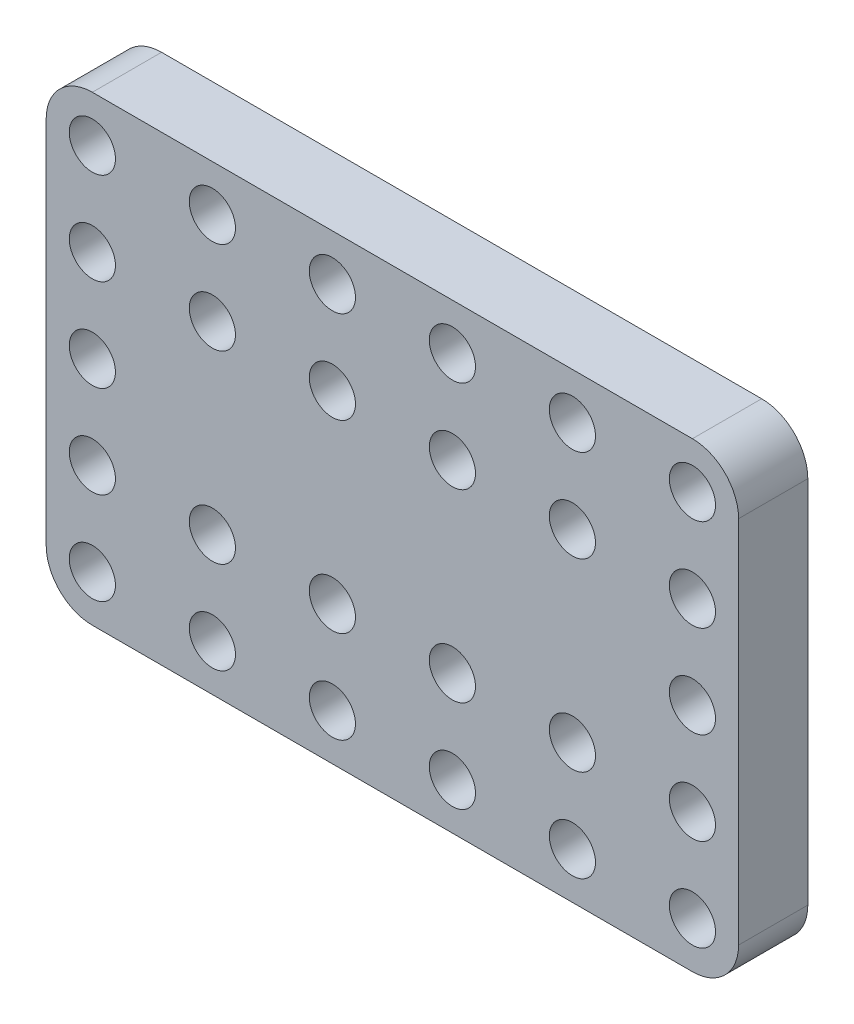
from build123d import *

# Parameters (mm, degrees)
SKETCH1_R      = 5
EXTRUDE1_DEPTH = 7.5


with BuildPart() as part:
    # Sketch1 → Extrude1 (new, symmetric)
    with BuildSketch(Plane.XY):
        with BuildLine():
            Line((10, 0), (140, 0))
            ThreePointArc((140, 0), (147.071067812, 2.928932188), (150, 10))
            Line((150, 10), (150, 90))
            ThreePointArc((150, 90), (147.071067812, 97.071067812), (140, 100))
            Line((140, 100), (10, 100))
            ThreePointArc((10, 100), (2.928932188, 97.071067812), (0, 90))
            Line((0, 90), (0, 10))
            ThreePointArc((0, 10), (2.928932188, 2.928932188), (10, 0))
        make_face()
        with Locations((10, 10)):
            Circle(SKETCH1_R, mode=Mode.SUBTRACT)
        with Locations((36, 10)):
            Circle(SKETCH1_R, mode=Mode.SUBTRACT)
        with Locations((62, 10)):
            Circle(SKETCH1_R, mode=Mode.SUBTRACT)
        with Locations((88, 10)):
            Circle(SKETCH1_R, mode=Mode.SUBTRACT)
        with Locations((114, 10)):
            Circle(SKETCH1_R, mode=Mode.SUBTRACT)
        with Locations((140, 10)):
            Circle(SKETCH1_R, mode=Mode.SUBTRACT)
        with Locations((10, 30)):
            Circle(SKETCH1_R, mode=Mode.SUBTRACT)
        with Locations((36, 30)):
            Circle(SKETCH1_R, mode=Mode.SUBTRACT)
        with Locations((62, 30)):
            Circle(SKETCH1_R, mode=Mode.SUBTRACT)
        with Locations((88, 30)):
            Circle(SKETCH1_R, mode=Mode.SUBTRACT)
        with Locations((114, 30)):
            Circle(SKETCH1_R, mode=Mode.SUBTRACT)
        with Locations((140, 30)):
            Circle(SKETCH1_R, mode=Mode.SUBTRACT)
        with Locations((10, 50)):
            Circle(SKETCH1_R, mode=Mode.SUBTRACT)
        with Locations((140, 50)):
            Circle(SKETCH1_R, mode=Mode.SUBTRACT)
        with Locations((10, 70)):
            Circle(SKETCH1_R, mode=Mode.SUBTRACT)
        with Locations((36, 70)):
            Circle(SKETCH1_R, mode=Mode.SUBTRACT)
        with Locations((62, 70)):
            Circle(SKETCH1_R, mode=Mode.SUBTRACT)
        with Locations((88, 70)):
            Circle(SKETCH1_R, mode=Mode.SUBTRACT)
        with Locations((114, 70)):
            Circle(SKETCH1_R, mode=Mode.SUBTRACT)
        with Locations((140, 70)):
            Circle(SKETCH1_R, mode=Mode.SUBTRACT)
        with Locations((10, 90)):
            Circle(SKETCH1_R, mode=Mode.SUBTRACT)
        with Locations((36, 90)):
            Circle(SKETCH1_R, mode=Mode.SUBTRACT)
        with Locations((62, 90)):
            Circle(SKETCH1_R, mode=Mode.SUBTRACT)
        with Locations((88, 90)):
            Circle(SKETCH1_R, mode=Mode.SUBTRACT)
        with Locations((114, 90)):
            Circle(SKETCH1_R, mode=Mode.SUBTRACT)
        with Locations((140, 90)):
            Circle(SKETCH1_R, mode=Mode.SUBTRACT)
    extrude(amount=EXTRUDE1_DEPTH, both=True)


solid = part.part
